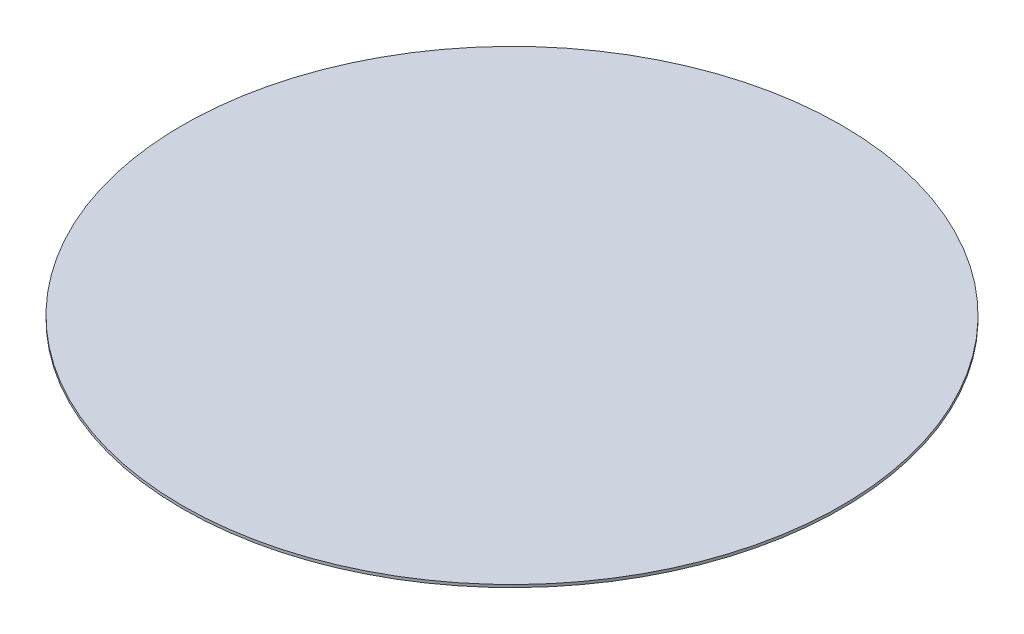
ISO-10303-21;
HEADER;
FILE_DESCRIPTION(('STEP AP214'),'2;1');
FILE_NAME('part.step','',(''),(''),'','','');
FILE_SCHEMA(('AUTOMOTIVE_DESIGN { 1 0 10303 214 1 1 1 1 }'));
ENDSEC;
DATA;
#1=APPLICATION_CONTEXT('core data for automotive mechanical design processes');
#2=APPLICATION_PROTOCOL_DEFINITION('international standard','automotive_design',2000,#1);
#3=PRODUCT_CONTEXT('',#1,'mechanical');
#4=PRODUCT('Part','Part','',(#3));
#5=PRODUCT_RELATED_PRODUCT_CATEGORY('part','',(#4));
#6=PRODUCT_DEFINITION_FORMATION('','',#4);
#7=PRODUCT_DEFINITION_CONTEXT('part definition',#1,'design');
#8=PRODUCT_DEFINITION('design','',#6,#7);
#9=PRODUCT_DEFINITION_SHAPE('','',#8);
#10=(LENGTH_UNIT() NAMED_UNIT(*) SI_UNIT(.MILLI.,.METRE.));
#11=(NAMED_UNIT(*) PLANE_ANGLE_UNIT() SI_UNIT($,.RADIAN.));
#12=(NAMED_UNIT(*) SI_UNIT($,.STERADIAN.) SOLID_ANGLE_UNIT());
#13=UNCERTAINTY_MEASURE_WITH_UNIT(LENGTH_MEASURE(1.E-05),#10,'distance_accuracy_value','');
#14=(GEOMETRIC_REPRESENTATION_CONTEXT(3) GLOBAL_UNCERTAINTY_ASSIGNED_CONTEXT((#13)) GLOBAL_UNIT_ASSIGNED_CONTEXT((#10,
#11,#12)) REPRESENTATION_CONTEXT('',''));
#15=CARTESIAN_POINT('',(0.,0.,0.));
#16=DIRECTION('',(0.,0.,1.));
#17=DIRECTION('',(1.,0.,0.));
#18=AXIS2_PLACEMENT_3D('',#15,#16,#17);
#19=CARTESIAN_POINT('',(0.,2.,0.));
#20=DIRECTION('',(0.,-1.,0.));
#21=DIRECTION('',(0.,0.,-1.));
#22=AXIS2_PLACEMENT_3D('',#19,#20,#21);
#23=CYLINDRICAL_SURFACE('',#22,247.);
#24=CARTESIAN_POINT('',(0.,2.,0.));
#25=DIRECTION('',(0.,1.,0.));
#26=DIRECTION('',(0.,0.,1.));
#27=AXIS2_PLACEMENT_3D('',#24,#25,#26);
#28=CIRCLE('',#27,247.);
#29=CARTESIAN_POINT('',(0.,2.,247.));
#30=VERTEX_POINT('',#29);
#31=EDGE_CURVE('E10',#30,#30,#28,.T.);
#32=ORIENTED_EDGE('',*,*,#31,.F.);
#33=EDGE_LOOP('',(#32));
#34=FACE_BOUND('',#33,.T.);
#35=CARTESIAN_POINT('',(0.,0.,0.));
#36=DIRECTION('',(0.,1.,0.));
#37=DIRECTION('',(0.,0.,1.));
#38=AXIS2_PLACEMENT_3D('',#35,#36,#37);
#39=CIRCLE('',#38,247.);
#40=CARTESIAN_POINT('',(0.,0.,247.));
#41=VERTEX_POINT('',#40);
#42=EDGE_CURVE('E40',#41,#41,#39,.T.);
#43=ORIENTED_EDGE('',*,*,#42,.T.);
#44=EDGE_LOOP('',(#43));
#45=FACE_BOUND('',#44,.T.);
#46=ADVANCED_FACE('F37',(#34,#45),#23,.T.);
#47=CARTESIAN_POINT('',(0.,2.,0.));
#48=DIRECTION('',(0.,1.,0.));
#49=DIRECTION('',(0.,0.,1.));
#50=AXIS2_PLACEMENT_3D('',#47,#48,#49);
#51=PLANE('',#50);
#52=ORIENTED_EDGE('',*,*,#31,.T.);
#53=EDGE_LOOP('',(#52));
#54=FACE_BOUND('',#53,.T.);
#55=ADVANCED_FACE('F54',(#54),#51,.T.);
#56=CARTESIAN_POINT('',(0.,0.,0.));
#57=DIRECTION('',(0.,1.,0.));
#58=DIRECTION('',(0.,0.,1.));
#59=AXIS2_PLACEMENT_3D('',#56,#57,#58);
#60=PLANE('',#59);
#61=ORIENTED_EDGE('',*,*,#42,.F.);
#62=EDGE_LOOP('',(#61));
#63=FACE_BOUND('',#62,.T.);
#64=ADVANCED_FACE('F52',(#63),#60,.F.);
#65=CLOSED_SHELL('',(#46,#55,#64));
#66=MANIFOLD_SOLID_BREP('B2',#65);
#67=ADVANCED_BREP_SHAPE_REPRESENTATION('',(#18,#66),#14);
#68=SHAPE_DEFINITION_REPRESENTATION(#9,#67);
ENDSEC;
END-ISO-10303-21;
